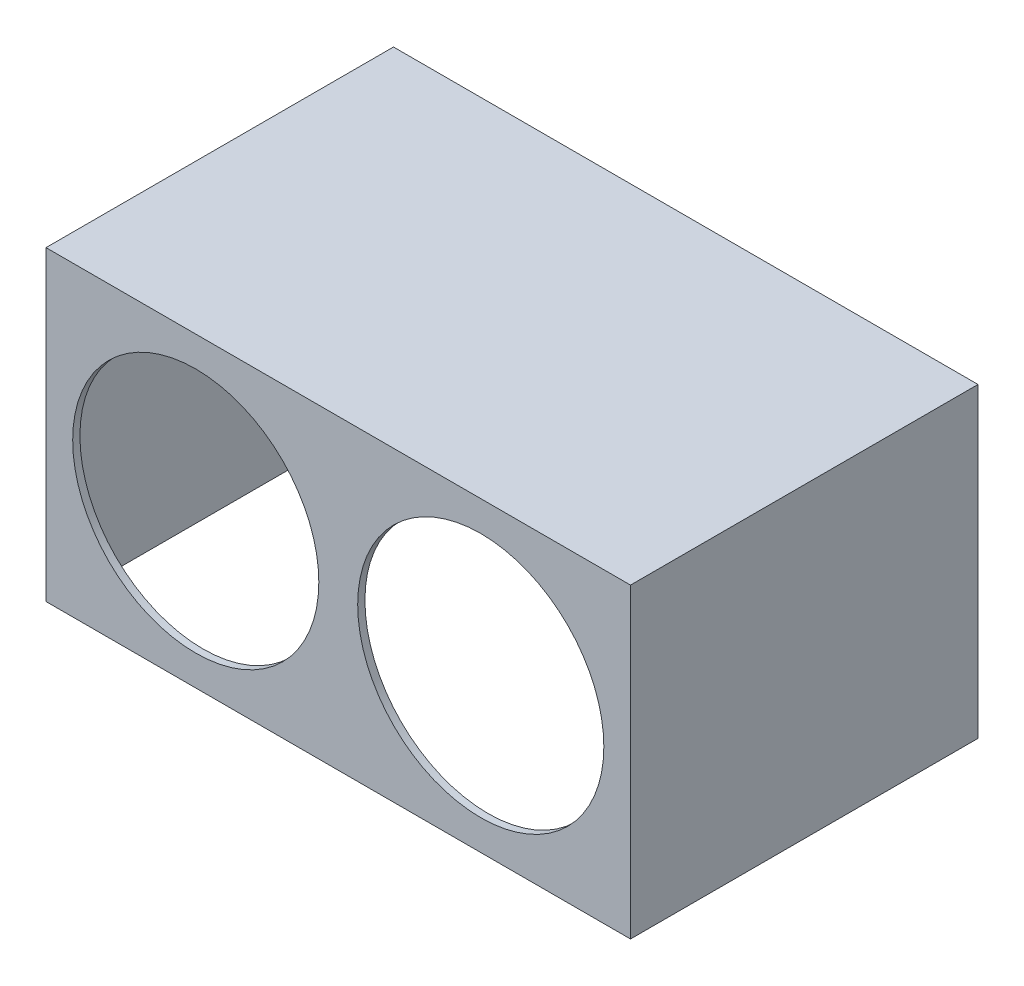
ISO-10303-21;
HEADER;
FILE_DESCRIPTION(('STEP AP214'),'2;1');
FILE_NAME('part.step','',(''),(''),'','','');
FILE_SCHEMA(('AUTOMOTIVE_DESIGN { 1 0 10303 214 1 1 1 1 }'));
ENDSEC;
DATA;
#1=APPLICATION_CONTEXT('core data for automotive mechanical design processes');
#2=APPLICATION_PROTOCOL_DEFINITION('international standard','automotive_design',2000,#1);
#3=PRODUCT_CONTEXT('',#1,'mechanical');
#4=PRODUCT('Part','Part','',(#3));
#5=PRODUCT_RELATED_PRODUCT_CATEGORY('part','',(#4));
#6=PRODUCT_DEFINITION_FORMATION('','',#4);
#7=PRODUCT_DEFINITION_CONTEXT('part definition',#1,'design');
#8=PRODUCT_DEFINITION('design','',#6,#7);
#9=PRODUCT_DEFINITION_SHAPE('','',#8);
#10=(LENGTH_UNIT() NAMED_UNIT(*) SI_UNIT(.MILLI.,.METRE.));
#11=(NAMED_UNIT(*) PLANE_ANGLE_UNIT() SI_UNIT($,.RADIAN.));
#12=(NAMED_UNIT(*) SI_UNIT($,.STERADIAN.) SOLID_ANGLE_UNIT());
#13=UNCERTAINTY_MEASURE_WITH_UNIT(LENGTH_MEASURE(1.E-05),#10,'distance_accuracy_value','');
#14=(GEOMETRIC_REPRESENTATION_CONTEXT(3) GLOBAL_UNCERTAINTY_ASSIGNED_CONTEXT((#13)) GLOBAL_UNIT_ASSIGNED_CONTEXT((#10,
#11,#12)) REPRESENTATION_CONTEXT('',''));
#15=CARTESIAN_POINT('',(0.,0.,0.));
#16=DIRECTION('',(0.,0.,1.));
#17=DIRECTION('',(1.,0.,0.));
#18=AXIS2_PLACEMENT_3D('',#15,#16,#17);
#19=CARTESIAN_POINT('',(250.,0.,-609.6001));
#20=DIRECTION('',(0.,0.,1.));
#21=DIRECTION('',(1.,0.,0.));
#22=AXIS2_PLACEMENT_3D('',#19,#20,#21);
#23=CYLINDRICAL_SURFACE('',#22,215.9);
#24=CARTESIAN_POINT('',(250.,0.,0.));
#25=DIRECTION('',(0.,0.,-1.));
#26=DIRECTION('',(-1.,0.,0.));
#27=AXIS2_PLACEMENT_3D('',#24,#25,#26);
#28=CIRCLE('',#27,215.9);
#29=CARTESIAN_POINT('',(34.1,0.,0.));
#30=VERTEX_POINT('',#29);
#31=EDGE_CURVE('E166',#30,#30,#28,.T.);
#32=ORIENTED_EDGE('',*,*,#31,.F.);
#33=EDGE_LOOP('',(#32));
#34=FACE_BOUND('',#33,.T.);
#35=CARTESIAN_POINT('',(250.,0.,-12.7));
#36=DIRECTION('',(0.,0.,-1.));
#37=DIRECTION('',(-1.,0.,0.));
#38=AXIS2_PLACEMENT_3D('',#35,#36,#37);
#39=CIRCLE('',#38,215.9);
#40=CARTESIAN_POINT('',(34.1,0.,-12.7));
#41=VERTEX_POINT('',#40);
#42=EDGE_CURVE('E160',#41,#41,#39,.T.);
#43=ORIENTED_EDGE('',*,*,#42,.T.);
#44=EDGE_LOOP('',(#43));
#45=FACE_BOUND('',#44,.T.);
#46=ADVANCED_FACE('F40',(#34,#45),#23,.F.);
#47=CARTESIAN_POINT('',(-250.,0.,-609.6001));
#48=DIRECTION('',(0.,0.,1.));
#49=DIRECTION('',(1.,0.,0.));
#50=AXIS2_PLACEMENT_3D('',#47,#48,#49);
#51=CYLINDRICAL_SURFACE('',#50,215.9);
#52=CARTESIAN_POINT('',(-250.,0.,0.));
#53=DIRECTION('',(0.,0.,-1.));
#54=DIRECTION('',(1.,0.,0.));
#55=AXIS2_PLACEMENT_3D('',#52,#53,#54);
#56=CIRCLE('',#55,215.9);
#57=CARTESIAN_POINT('',(-34.1,0.,0.));
#58=VERTEX_POINT('',#57);
#59=EDGE_CURVE('E163',#58,#58,#56,.T.);
#60=ORIENTED_EDGE('',*,*,#59,.F.);
#61=EDGE_LOOP('',(#60));
#62=FACE_BOUND('',#61,.T.);
#63=CARTESIAN_POINT('',(-250.,0.,-12.7));
#64=DIRECTION('',(0.,0.,-1.));
#65=DIRECTION('',(-1.,0.,0.));
#66=AXIS2_PLACEMENT_3D('',#63,#64,#65);
#67=CIRCLE('',#66,215.9);
#68=CARTESIAN_POINT('',(-465.9,0.,-12.7));
#69=VERTEX_POINT('',#68);
#70=EDGE_CURVE('E153',#69,#69,#67,.T.);
#71=ORIENTED_EDGE('',*,*,#70,.T.);
#72=EDGE_LOOP('',(#71));
#73=FACE_BOUND('',#72,.T.);
#74=ADVANCED_FACE('F333',(#62,#73),#51,.F.);
#75=CARTESIAN_POINT('',(512.699,268.859,0.));
#76=DIRECTION('',(0.,0.,-1.));
#77=DIRECTION('',(-1.,0.,0.));
#78=AXIS2_PLACEMENT_3D('',#75,#76,#77);
#79=PLANE('',#78);
#80=ORIENTED_EDGE('',*,*,#31,.T.);
#81=EDGE_LOOP('',(#80));
#82=FACE_BOUND('',#81,.T.);
#83=DIRECTION('',(0.,1.,0.));
#84=VECTOR('',#83,1.);
#85=CARTESIAN_POINT('',(512.699,268.859,0.));
#86=LINE('',#85,#84);
#87=CARTESIAN_POINT('',(512.699,-268.859,0.));
#88=VERTEX_POINT('',#87);
#89=CARTESIAN_POINT('',(512.699,268.859,0.));
#90=VERTEX_POINT('',#89);
#91=EDGE_CURVE('E169',#88,#90,#86,.T.);
#92=ORIENTED_EDGE('',*,*,#91,.T.);
#93=DIRECTION('',(-1.,0.,0.));
#94=VECTOR('',#93,1.);
#95=CARTESIAN_POINT('',(512.699,268.859,0.));
#96=LINE('',#95,#94);
#97=CARTESIAN_POINT('',(-512.701,268.859,0.));
#98=VERTEX_POINT('',#97);
#99=EDGE_CURVE('E439',#90,#98,#96,.T.);
#100=ORIENTED_EDGE('',*,*,#99,.T.);
#101=DIRECTION('',(0.,-1.,0.));
#102=VECTOR('',#101,1.);
#103=CARTESIAN_POINT('',(-512.701,268.859,0.));
#104=LINE('',#103,#102);
#105=CARTESIAN_POINT('',(-512.701,-268.859,0.));
#106=VERTEX_POINT('',#105);
#107=EDGE_CURVE('E79',#98,#106,#104,.T.);
#108=ORIENTED_EDGE('',*,*,#107,.T.);
#109=DIRECTION('',(1.,0.,0.));
#110=VECTOR('',#109,1.);
#111=CARTESIAN_POINT('',(512.699,-268.859,0.));
#112=LINE('',#111,#110);
#113=EDGE_CURVE('E84',#106,#88,#112,.T.);
#114=ORIENTED_EDGE('',*,*,#113,.T.);
#115=EDGE_LOOP('',(#92,#100,#108,#114));
#116=FACE_BOUND('',#115,.T.);
#117=ORIENTED_EDGE('',*,*,#59,.T.);
#118=EDGE_LOOP('',(#117));
#119=FACE_BOUND('',#118,.T.);
#120=ADVANCED_FACE('F42',(#82,#116,#119),#79,.F.);
#121=CARTESIAN_POINT('',(-512.701,-268.859,-609.6));
#122=DIRECTION('',(0.,0.,1.));
#123=DIRECTION('',(1.,0.,0.));
#124=AXIS2_PLACEMENT_3D('',#121,#122,#123);
#125=PLANE('',#124);
#126=DIRECTION('',(1.,0.,0.));
#127=VECTOR('',#126,1.);
#128=CARTESIAN_POINT('',(-512.701,-268.859,-609.6));
#129=LINE('',#128,#127);
#130=CARTESIAN_POINT('',(499.999,-268.859,-609.6));
#131=VERTEX_POINT('',#130);
#132=CARTESIAN_POINT('',(512.699,-268.859,-609.6));
#133=VERTEX_POINT('',#132);
#134=EDGE_CURVE('E274',#131,#133,#129,.T.);
#135=ORIENTED_EDGE('',*,*,#134,.F.);
#136=DIRECTION('',(0.,-1.,0.));
#137=VECTOR('',#136,1.);
#138=CARTESIAN_POINT('',(499.999,256.159,-609.6));
#139=LINE('',#138,#137);
#140=CARTESIAN_POINT('',(499.999,256.159,-609.6));
#141=VERTEX_POINT('',#140);
#142=EDGE_CURVE('E148',#141,#131,#139,.T.);
#143=ORIENTED_EDGE('',*,*,#142,.F.);
#144=DIRECTION('',(1.,0.,0.));
#145=VECTOR('',#144,1.);
#146=CARTESIAN_POINT('',(499.999,256.159,-609.6));
#147=LINE('',#146,#145);
#148=CARTESIAN_POINT('',(-500.001,256.159,-609.6));
#149=VERTEX_POINT('',#148);
#150=EDGE_CURVE('E154',#149,#141,#147,.T.);
#151=ORIENTED_EDGE('',*,*,#150,.F.);
#152=DIRECTION('',(0.,1.,0.));
#153=VECTOR('',#152,1.);
#154=CARTESIAN_POINT('',(-500.001,256.159,-609.6));
#155=LINE('',#154,#153);
#156=CARTESIAN_POINT('',(-500.001,-268.859,-609.6));
#157=VERTEX_POINT('',#156);
#158=EDGE_CURVE('E157',#157,#149,#155,.T.);
#159=ORIENTED_EDGE('',*,*,#158,.F.);
#160=CARTESIAN_POINT('',(-512.701,-268.859,-609.6));
#161=VERTEX_POINT('',#160);
#162=EDGE_CURVE('E60',#161,#157,#129,.T.);
#163=ORIENTED_EDGE('',*,*,#162,.F.);
#164=DIRECTION('',(0.,-1.,0.));
#165=VECTOR('',#164,1.);
#166=CARTESIAN_POINT('',(-512.701,268.859,-609.6));
#167=LINE('',#166,#165);
#168=CARTESIAN_POINT('',(-512.701,268.859,-609.6));
#169=VERTEX_POINT('',#168);
#170=EDGE_CURVE('E421',#169,#161,#167,.T.);
#171=ORIENTED_EDGE('',*,*,#170,.F.);
#172=DIRECTION('',(-1.,0.,0.));
#173=VECTOR('',#172,1.);
#174=CARTESIAN_POINT('',(-512.701,268.859,-609.6));
#175=LINE('',#174,#173);
#176=CARTESIAN_POINT('',(512.699,268.859,-609.6));
#177=VERTEX_POINT('',#176);
#178=EDGE_CURVE('E13',#177,#169,#175,.T.);
#179=ORIENTED_EDGE('',*,*,#178,.F.);
#180=DIRECTION('',(0.,1.,0.));
#181=VECTOR('',#180,1.);
#182=CARTESIAN_POINT('',(512.699,268.859,-609.6));
#183=LINE('',#182,#181);
#184=EDGE_CURVE('E51',#133,#177,#183,.T.);
#185=ORIENTED_EDGE('',*,*,#184,.F.);
#186=EDGE_LOOP('',(#135,#143,#151,#159,#163,#171,#179,#185));
#187=FACE_BOUND('',#186,.T.);
#188=ADVANCED_FACE('F243',(#187),#125,.F.);
#189=CARTESIAN_POINT('',(-512.701,-268.859,-609.6));
#190=DIRECTION('',(1.,0.,0.));
#191=DIRECTION('',(0.,0.,-1.));
#192=AXIS2_PLACEMENT_3D('',#189,#190,#191);
#193=PLANE('',#192);
#194=DIRECTION('',(0.,0.,1.));
#195=VECTOR('',#194,1.);
#196=CARTESIAN_POINT('',(-512.701,-268.859,-609.6));
#197=LINE('',#196,#195);
#198=EDGE_CURVE('E260',#161,#106,#197,.T.);
#199=ORIENTED_EDGE('',*,*,#198,.T.);
#200=ORIENTED_EDGE('',*,*,#107,.F.);
#201=DIRECTION('',(0.,0.,1.));
#202=VECTOR('',#201,1.);
#203=CARTESIAN_POINT('',(-512.701,268.859,-609.6));
#204=LINE('',#203,#202);
#205=EDGE_CURVE('E91',#169,#98,#204,.T.);
#206=ORIENTED_EDGE('',*,*,#205,.F.);
#207=ORIENTED_EDGE('',*,*,#170,.T.);
#208=EDGE_LOOP('',(#199,#200,#206,#207));
#209=FACE_BOUND('',#208,.T.);
#210=ADVANCED_FACE('F189',(#209),#193,.F.);
#211=CARTESIAN_POINT('',(-512.701,268.859,-609.6));
#212=DIRECTION('',(0.,-1.,0.));
#213=DIRECTION('',(0.,0.,-1.));
#214=AXIS2_PLACEMENT_3D('',#211,#212,#213);
#215=PLANE('',#214);
#216=ORIENTED_EDGE('',*,*,#205,.T.);
#217=ORIENTED_EDGE('',*,*,#99,.F.);
#218=DIRECTION('',(0.,0.,1.));
#219=VECTOR('',#218,1.);
#220=CARTESIAN_POINT('',(512.699,268.859,-609.6));
#221=LINE('',#220,#219);
#222=EDGE_CURVE('E177',#177,#90,#221,.T.);
#223=ORIENTED_EDGE('',*,*,#222,.F.);
#224=ORIENTED_EDGE('',*,*,#178,.T.);
#225=EDGE_LOOP('',(#216,#217,#223,#224));
#226=FACE_BOUND('',#225,.T.);
#227=ADVANCED_FACE('F179',(#226),#215,.F.);
#228=CARTESIAN_POINT('',(512.699,-268.859,0.));
#229=DIRECTION('',(0.,1.,0.));
#230=DIRECTION('',(-1.,0.,0.));
#231=AXIS2_PLACEMENT_3D('',#228,#229,#230);
#232=PLANE('',#231);
#233=DIRECTION('',(1.,0.,0.));
#234=VECTOR('',#233,1.);
#235=CARTESIAN_POINT('',(512.699,-268.859,-12.6999999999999));
#236=LINE('',#235,#234);
#237=CARTESIAN_POINT('',(-500.001,-268.859,-12.6999999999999));
#238=VERTEX_POINT('',#237);
#239=CARTESIAN_POINT('',(499.999,-268.859,-12.6999999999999));
#240=VERTEX_POINT('',#239);
#241=EDGE_CURVE('E132',#238,#240,#236,.T.);
#242=ORIENTED_EDGE('',*,*,#241,.T.);
#243=DIRECTION('',(0.,0.,-1.));
#244=VECTOR('',#243,1.);
#245=CARTESIAN_POINT('',(499.999,-268.859,0.));
#246=LINE('',#245,#244);
#247=EDGE_CURVE('E138',#240,#131,#246,.T.);
#248=ORIENTED_EDGE('',*,*,#247,.T.);
#249=ORIENTED_EDGE('',*,*,#134,.T.);
#250=DIRECTION('',(0.,0.,1.));
#251=VECTOR('',#250,1.);
#252=CARTESIAN_POINT('',(512.699,-268.859,-609.6));
#253=LINE('',#252,#251);
#254=EDGE_CURVE('E258',#133,#88,#253,.T.);
#255=ORIENTED_EDGE('',*,*,#254,.T.);
#256=ORIENTED_EDGE('',*,*,#113,.F.);
#257=ORIENTED_EDGE('',*,*,#198,.F.);
#258=ORIENTED_EDGE('',*,*,#162,.T.);
#259=DIRECTION('',(0.,0.,1.));
#260=VECTOR('',#259,1.);
#261=CARTESIAN_POINT('',(-500.001,-268.859,0.));
#262=LINE('',#261,#260);
#263=EDGE_CURVE('E124',#157,#238,#262,.T.);
#264=ORIENTED_EDGE('',*,*,#263,.T.);
#265=EDGE_LOOP('',(#242,#248,#249,#255,#256,#257,#258,#264));
#266=FACE_BOUND('',#265,.T.);
#267=ADVANCED_FACE('F140',(#266),#232,.F.);
#268=CARTESIAN_POINT('',(512.699,268.859,0.));
#269=DIRECTION('',(-1.,0.,0.));
#270=DIRECTION('',(0.,0.,1.));
#271=AXIS2_PLACEMENT_3D('',#268,#269,#270);
#272=PLANE('',#271);
#273=ORIENTED_EDGE('',*,*,#222,.T.);
#274=ORIENTED_EDGE('',*,*,#91,.F.);
#275=ORIENTED_EDGE('',*,*,#254,.F.);
#276=ORIENTED_EDGE('',*,*,#184,.T.);
#277=EDGE_LOOP('',(#273,#274,#275,#276));
#278=FACE_BOUND('',#277,.T.);
#279=ADVANCED_FACE('F234',(#278),#272,.F.);
#280=CARTESIAN_POINT('',(499.999,256.159,1123.59678404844));
#281=DIRECTION('',(1.,0.,0.));
#282=DIRECTION('',(0.,1.,0.));
#283=AXIS2_PLACEMENT_3D('',#280,#281,#282);
#284=PLANE('',#283);
#285=DIRECTION('',(0.,1.,0.));
#286=VECTOR('',#285,1.);
#287=CARTESIAN_POINT('',(499.999,256.159,-12.6999999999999));
#288=LINE('',#287,#286);
#289=CARTESIAN_POINT('',(499.999,256.159,-12.6999999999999));
#290=VERTEX_POINT('',#289);
#291=EDGE_CURVE('E134',#240,#290,#288,.T.);
#292=ORIENTED_EDGE('',*,*,#291,.T.);
#293=DIRECTION('',(0.,0.,-1.));
#294=VECTOR('',#293,1.);
#295=CARTESIAN_POINT('',(499.999,256.159,1123.59678404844));
#296=LINE('',#295,#294);
#297=EDGE_CURVE('E129',#290,#141,#296,.T.);
#298=ORIENTED_EDGE('',*,*,#297,.T.);
#299=ORIENTED_EDGE('',*,*,#142,.T.);
#300=ORIENTED_EDGE('',*,*,#247,.F.);
#301=EDGE_LOOP('',(#292,#298,#299,#300));
#302=FACE_BOUND('',#301,.T.);
#303=ADVANCED_FACE('F242',(#302),#284,.F.);
#304=CARTESIAN_POINT('',(499.999,256.159,1123.59678404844));
#305=DIRECTION('',(0.,1.,0.));
#306=DIRECTION('',(0.,0.,1.));
#307=AXIS2_PLACEMENT_3D('',#304,#305,#306);
#308=PLANE('',#307);
#309=DIRECTION('',(-1.,0.,0.));
#310=VECTOR('',#309,1.);
#311=CARTESIAN_POINT('',(499.999,256.159,-12.6999999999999));
#312=LINE('',#311,#310);
#313=CARTESIAN_POINT('',(-500.001,256.159,-12.6999999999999));
#314=VERTEX_POINT('',#313);
#315=EDGE_CURVE('E128',#290,#314,#312,.T.);
#316=ORIENTED_EDGE('',*,*,#315,.T.);
#317=DIRECTION('',(0.,0.,-1.));
#318=VECTOR('',#317,1.);
#319=CARTESIAN_POINT('',(-500.001,256.159,1123.59678404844));
#320=LINE('',#319,#318);
#321=EDGE_CURVE('E125',#314,#149,#320,.T.);
#322=ORIENTED_EDGE('',*,*,#321,.T.);
#323=ORIENTED_EDGE('',*,*,#150,.T.);
#324=ORIENTED_EDGE('',*,*,#297,.F.);
#325=EDGE_LOOP('',(#316,#322,#323,#324));
#326=FACE_BOUND('',#325,.T.);
#327=ADVANCED_FACE('F322',(#326),#308,.F.);
#328=CARTESIAN_POINT('',(-500.001,256.159,1123.59678404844));
#329=DIRECTION('',(-1.,0.,0.));
#330=DIRECTION('',(0.,0.,1.));
#331=AXIS2_PLACEMENT_3D('',#328,#329,#330);
#332=PLANE('',#331);
#333=DIRECTION('',(0.,-1.,0.));
#334=VECTOR('',#333,1.);
#335=CARTESIAN_POINT('',(-500.001,256.159,-12.6999999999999));
#336=LINE('',#335,#334);
#337=EDGE_CURVE('E119',#314,#238,#336,.T.);
#338=ORIENTED_EDGE('',*,*,#337,.T.);
#339=ORIENTED_EDGE('',*,*,#263,.F.);
#340=ORIENTED_EDGE('',*,*,#158,.T.);
#341=ORIENTED_EDGE('',*,*,#321,.F.);
#342=EDGE_LOOP('',(#338,#339,#340,#341));
#343=FACE_BOUND('',#342,.T.);
#344=ADVANCED_FACE('F121',(#343),#332,.F.);
#345=CARTESIAN_POINT('',(512.699,268.859,-12.7));
#346=DIRECTION('',(0.,0.,-1.));
#347=DIRECTION('',(-1.,0.,0.));
#348=AXIS2_PLACEMENT_3D('',#345,#346,#347);
#349=PLANE('',#348);
#350=ORIENTED_EDGE('',*,*,#42,.F.);
#351=EDGE_LOOP('',(#350));
#352=FACE_BOUND('',#351,.T.);
#353=ORIENTED_EDGE('',*,*,#70,.F.);
#354=EDGE_LOOP('',(#353));
#355=FACE_BOUND('',#354,.T.);
#356=ORIENTED_EDGE('',*,*,#291,.F.);
#357=ORIENTED_EDGE('',*,*,#241,.F.);
#358=ORIENTED_EDGE('',*,*,#337,.F.);
#359=ORIENTED_EDGE('',*,*,#315,.F.);
#360=EDGE_LOOP('',(#356,#357,#358,#359));
#361=FACE_BOUND('',#360,.T.);
#362=ADVANCED_FACE('F133',(#352,#355,#361),#349,.T.);
#363=CLOSED_SHELL('',(#46,#74,#120,#188,#210,#227,#267,#279,#303,#327,#344,#362));
#364=MANIFOLD_SOLID_BREP('B2',#363);
#365=ADVANCED_BREP_SHAPE_REPRESENTATION('',(#18,#364),#14);
#366=SHAPE_DEFINITION_REPRESENTATION(#9,#365);
ENDSEC;
END-ISO-10303-21;
